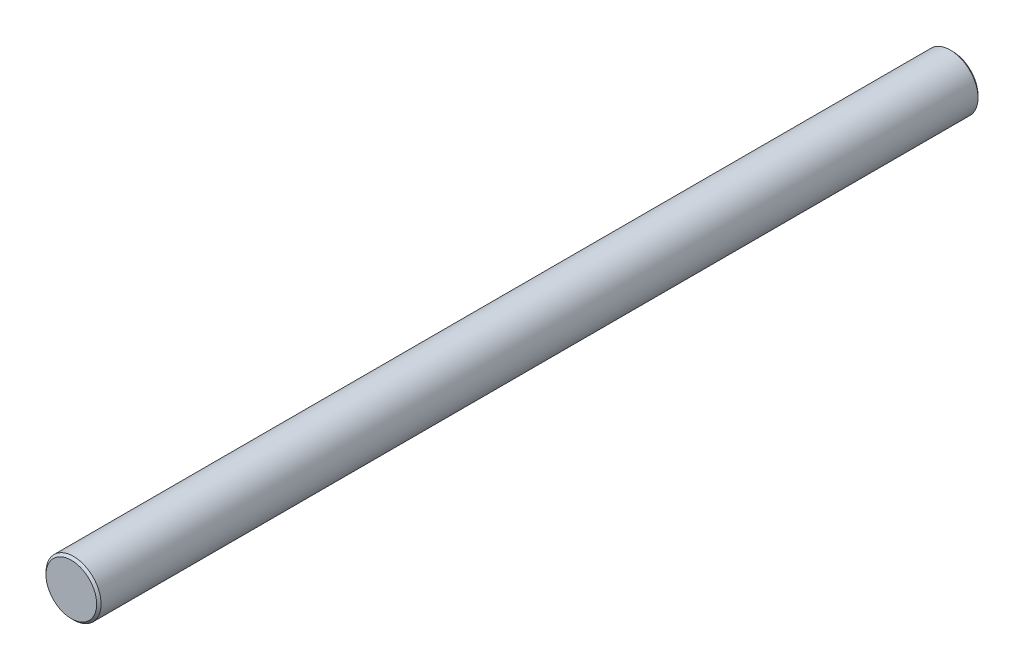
ISO-10303-21;
HEADER;
FILE_DESCRIPTION(('STEP AP214'),'2;1');
FILE_NAME('part.step','',(''),(''),'','','');
FILE_SCHEMA(('AUTOMOTIVE_DESIGN { 1 0 10303 214 1 1 1 1 }'));
ENDSEC;
DATA;
#1=APPLICATION_CONTEXT('core data for automotive mechanical design processes');
#2=APPLICATION_PROTOCOL_DEFINITION('international standard','automotive_design',2000,#1);
#3=PRODUCT_CONTEXT('',#1,'mechanical');
#4=PRODUCT('Part','Part','',(#3));
#5=PRODUCT_RELATED_PRODUCT_CATEGORY('part','',(#4));
#6=PRODUCT_DEFINITION_FORMATION('','',#4);
#7=PRODUCT_DEFINITION_CONTEXT('part definition',#1,'design');
#8=PRODUCT_DEFINITION('design','',#6,#7);
#9=PRODUCT_DEFINITION_SHAPE('','',#8);
#10=(LENGTH_UNIT() NAMED_UNIT(*) SI_UNIT(.MILLI.,.METRE.));
#11=(NAMED_UNIT(*) PLANE_ANGLE_UNIT() SI_UNIT($,.RADIAN.));
#12=(NAMED_UNIT(*) SI_UNIT($,.STERADIAN.) SOLID_ANGLE_UNIT());
#13=UNCERTAINTY_MEASURE_WITH_UNIT(LENGTH_MEASURE(1.E-05),#10,'distance_accuracy_value','');
#14=(GEOMETRIC_REPRESENTATION_CONTEXT(3) GLOBAL_UNCERTAINTY_ASSIGNED_CONTEXT((#13)) GLOBAL_UNIT_ASSIGNED_CONTEXT((#10,
#11,#12)) REPRESENTATION_CONTEXT('',''));
#15=CARTESIAN_POINT('',(0.,0.,0.));
#16=DIRECTION('',(0.,0.,1.));
#17=DIRECTION('',(1.,0.,0.));
#18=AXIS2_PLACEMENT_3D('',#15,#16,#17);
#19=CARTESIAN_POINT('',(0.,0.,304.8));
#20=DIRECTION('',(0.,0.,-1.));
#21=DIRECTION('',(-1.,0.,0.));
#22=AXIS2_PLACEMENT_3D('',#19,#20,#21);
#23=CYLINDRICAL_SURFACE('',#22,9.525);
#24=CARTESIAN_POINT('',(0.,0.,0.762000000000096));
#25=DIRECTION('',(0.,0.,1.));
#26=DIRECTION('',(1.,0.,0.));
#27=AXIS2_PLACEMENT_3D('',#24,#25,#26);
#28=CIRCLE('',#27,9.525);
#29=CARTESIAN_POINT('',(-9.525,0.,0.76200000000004));
#30=VERTEX_POINT('',#29);
#31=EDGE_CURVE('E42',#30,#30,#28,.T.);
#32=CARTESIAN_POINT('',(0.,0.,304.038));
#33=DIRECTION('',(0.,0.,1.));
#34=DIRECTION('',(1.,0.,0.));
#35=AXIS2_PLACEMENT_3D('',#32,#33,#34);
#36=CIRCLE('',#35,9.525);
#37=CARTESIAN_POINT('',(-9.525,0.,304.038));
#38=VERTEX_POINT('',#37);
#39=EDGE_CURVE('E46',#38,#38,#36,.F.);
#40=CARTESIAN_POINT('',(-9.525,0.,0.76200000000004));
#41=CARTESIAN_POINT('',(-9.525,0.,3.92112500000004));
#42=CARTESIAN_POINT('',(-9.525,0.,7.08025000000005));
#43=CARTESIAN_POINT('',(-9.525,0.,13.3985000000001));
#44=CARTESIAN_POINT('',(-9.525,0.,16.5576250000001));
#45=CARTESIAN_POINT('',(-9.525,0.,22.875875));
#46=CARTESIAN_POINT('',(-9.525,0.,26.035));
#47=CARTESIAN_POINT('',(-9.525,0.,32.35325));
#48=CARTESIAN_POINT('',(-9.525,0.,35.512375));
#49=CARTESIAN_POINT('',(-9.525,0.,41.830625));
#50=CARTESIAN_POINT('',(-9.525,0.,44.98975));
#51=CARTESIAN_POINT('',(-9.525,0.,51.308));
#52=CARTESIAN_POINT('',(-9.525,0.,54.467125));
#53=CARTESIAN_POINT('',(-9.525,0.,60.785375));
#54=CARTESIAN_POINT('',(-9.525,0.,63.9445));
#55=CARTESIAN_POINT('',(-9.525,0.,70.26275));
#56=CARTESIAN_POINT('',(-9.525,0.,73.421875));
#57=CARTESIAN_POINT('',(-9.525,0.,79.740125));
#58=CARTESIAN_POINT('',(-9.525,0.,82.89925));
#59=CARTESIAN_POINT('',(-9.525,0.,89.2175));
#60=CARTESIAN_POINT('',(-9.525,0.,92.376625));
#61=CARTESIAN_POINT('',(-9.525,0.,98.694875));
#62=CARTESIAN_POINT('',(-9.525,0.,101.854));
#63=CARTESIAN_POINT('',(-9.525,0.,108.17225));
#64=CARTESIAN_POINT('',(-9.525,0.,111.331375));
#65=CARTESIAN_POINT('',(-9.525,0.,117.649625));
#66=CARTESIAN_POINT('',(-9.525,0.,120.80875));
#67=CARTESIAN_POINT('',(-9.525,0.,127.127));
#68=CARTESIAN_POINT('',(-9.525,0.,130.286125));
#69=CARTESIAN_POINT('',(-9.525,0.,136.604375));
#70=CARTESIAN_POINT('',(-9.525,0.,139.7635));
#71=CARTESIAN_POINT('',(-9.525,0.,146.08175));
#72=CARTESIAN_POINT('',(-9.525,0.,149.240875));
#73=CARTESIAN_POINT('',(-9.525,0.,155.559125));
#74=CARTESIAN_POINT('',(-9.525,0.,158.71825));
#75=CARTESIAN_POINT('',(-9.525,0.,165.0365));
#76=CARTESIAN_POINT('',(-9.525,0.,168.195625));
#77=CARTESIAN_POINT('',(-9.525,0.,174.513875));
#78=CARTESIAN_POINT('',(-9.525,0.,177.673));
#79=CARTESIAN_POINT('',(-9.525,0.,183.99125));
#80=CARTESIAN_POINT('',(-9.525,0.,187.150375));
#81=CARTESIAN_POINT('',(-9.525,0.,193.468625));
#82=CARTESIAN_POINT('',(-9.525,0.,196.62775));
#83=CARTESIAN_POINT('',(-9.525,0.,202.946));
#84=CARTESIAN_POINT('',(-9.525,0.,206.105125));
#85=CARTESIAN_POINT('',(-9.525,0.,212.423375));
#86=CARTESIAN_POINT('',(-9.525,0.,215.5825));
#87=CARTESIAN_POINT('',(-9.525,0.,221.90075));
#88=CARTESIAN_POINT('',(-9.525,0.,225.059875));
#89=CARTESIAN_POINT('',(-9.525,0.,231.378125));
#90=CARTESIAN_POINT('',(-9.525,0.,234.53725));
#91=CARTESIAN_POINT('',(-9.525,0.,240.8555));
#92=CARTESIAN_POINT('',(-9.525,0.,244.014625));
#93=CARTESIAN_POINT('',(-9.525,0.,250.332875));
#94=CARTESIAN_POINT('',(-9.525,0.,253.492));
#95=CARTESIAN_POINT('',(-9.525,0.,259.81025));
#96=CARTESIAN_POINT('',(-9.525,0.,262.969375));
#97=CARTESIAN_POINT('',(-9.525,0.,269.287625));
#98=CARTESIAN_POINT('',(-9.525,0.,272.44675));
#99=CARTESIAN_POINT('',(-9.525,0.,278.765));
#100=CARTESIAN_POINT('',(-9.525,0.,281.924125));
#101=CARTESIAN_POINT('',(-9.525,0.,288.242375));
#102=CARTESIAN_POINT('',(-9.525,0.,291.4015));
#103=CARTESIAN_POINT('',(-9.525,0.,297.71975));
#104=CARTESIAN_POINT('',(-9.525,0.,300.878875));
#105=CARTESIAN_POINT('',(-9.525,0.,304.038));
#106=B_SPLINE_CURVE_WITH_KNOTS('',3,(#40,#41,#42,#43,#44,#45,#46,#47,#48,#49,#50,#51,#52,#53,
#54,#55,#56,#57,#58,#59,#60,#61,#62,#63,#64,#65,#66,#67,#68,#69,#70,#71,#72,#73,#74,#75,#76,#77,
#78,#79,#80,#81,#82,#83,#84,#85,#86,#87,#88,#89,#90,#91,#92,#93,#94,#95,#96,#97,#98,#99,#100,
#101,#102,#103,#104,#105),.UNSPECIFIED.,.F.,.F.,(4,2,2,2,2,2,2,2,2,2,2,2,2,2,2,2,2,2,2,2,2,2,2,
2,2,2,2,2,2,2,2,2,4),(0.,9.47737500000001,18.95475,28.432125,37.9095,47.386875,56.86425,
66.341625,75.819,85.296375,94.77375,104.251125,113.7285,123.205875,132.68325,142.160625,151.638,
161.115375,170.59275,180.070125,189.5475,199.024875,208.50225,217.979625,227.457,236.934375,
246.41175,255.889125,265.3665,274.843875,284.32125,293.798625,303.276),.UNSPECIFIED.);
#107=EDGE_CURVE('BSEAM31',#30,#38,#106,.T.);
#108=ORIENTED_EDGE('',*,*,#31,.T.);
#109=ORIENTED_EDGE('',*,*,#39,.T.);
#110=ORIENTED_EDGE('',*,*,#107,.T.);
#111=ORIENTED_EDGE('',*,*,#107,.F.);
#112=EDGE_LOOP('',(#108,#110,#109,#111));
#113=FACE_BOUND('',#112,.T.);
#114=ADVANCED_FACE('F31',(#113),#23,.T.);
#115=CARTESIAN_POINT('',(0.,0.,304.8));
#116=DIRECTION('',(0.,0.,1.));
#117=DIRECTION('',(1.,0.,0.));
#118=AXIS2_PLACEMENT_3D('',#115,#116,#117);
#119=PLANE('',#118);
#120=CARTESIAN_POINT('',(0.,0.,304.8));
#121=DIRECTION('',(0.,0.,1.));
#122=DIRECTION('',(1.,0.,0.));
#123=AXIS2_PLACEMENT_3D('',#120,#121,#122);
#124=CIRCLE('',#123,8.76300000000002);
#125=CARTESIAN_POINT('',(8.76300000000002,0.,304.8));
#126=VERTEX_POINT('',#125);
#127=EDGE_CURVE('E10',#126,#126,#124,.T.);
#128=ORIENTED_EDGE('',*,*,#127,.T.);
#129=EDGE_LOOP('',(#128));
#130=FACE_BOUND('',#129,.T.);
#131=ADVANCED_FACE('F62',(#130),#119,.T.);
#132=CARTESIAN_POINT('',(0.,0.,0.));
#133=DIRECTION('',(0.,0.,1.));
#134=DIRECTION('',(1.,0.,0.));
#135=AXIS2_PLACEMENT_3D('',#132,#133,#134);
#136=PLANE('',#135);
#137=CARTESIAN_POINT('',(0.,0.,0.));
#138=DIRECTION('',(0.,0.,1.));
#139=DIRECTION('',(1.,0.,0.));
#140=AXIS2_PLACEMENT_3D('',#137,#138,#139);
#141=CIRCLE('',#140,8.76299999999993);
#142=CARTESIAN_POINT('',(8.76299999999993,0.,0.));
#143=VERTEX_POINT('',#142);
#144=EDGE_CURVE('E38',#143,#143,#141,.F.);
#145=ORIENTED_EDGE('',*,*,#144,.T.);
#146=EDGE_LOOP('',(#145));
#147=FACE_BOUND('',#146,.T.);
#148=ADVANCED_FACE('F59',(#147),#136,.F.);
#149=CARTESIAN_POINT('',(0.,0.,0.762000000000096));
#150=DIRECTION('',(0.,0.,1.));
#151=DIRECTION('',(1.,0.,0.));
#152=AXIS2_PLACEMENT_3D('',#149,#150,#151);
#153=CONICAL_SURFACE('',#152,9.525,0.785398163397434);
#154=ORIENTED_EDGE('',*,*,#144,.F.);
#155=EDGE_LOOP('',(#154));
#156=FACE_BOUND('',#155,.T.);
#157=ORIENTED_EDGE('',*,*,#31,.F.);
#158=EDGE_LOOP('',(#157));
#159=FACE_BOUND('',#158,.T.);
#160=ADVANCED_FACE('F55',(#156,#159),#153,.T.);
#161=CARTESIAN_POINT('',(0.,0.,304.8));
#162=DIRECTION('',(0.,0.,-1.));
#163=DIRECTION('',(-1.,0.,0.));
#164=AXIS2_PLACEMENT_3D('',#161,#162,#163);
#165=CONICAL_SURFACE('',#164,8.76300000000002,0.785398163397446);
#166=ORIENTED_EDGE('',*,*,#39,.F.);
#167=EDGE_LOOP('',(#166));
#168=FACE_BOUND('',#167,.T.);
#169=ORIENTED_EDGE('',*,*,#127,.F.);
#170=EDGE_LOOP('',(#169));
#171=FACE_BOUND('',#170,.T.);
#172=ADVANCED_FACE('F33',(#168,#171),#165,.T.);
#173=CLOSED_SHELL('',(#114,#131,#148,#160,#172));
#174=MANIFOLD_SOLID_BREP('B2',#173);
#175=ADVANCED_BREP_SHAPE_REPRESENTATION('',(#18,#174),#14);
#176=SHAPE_DEFINITION_REPRESENTATION(#9,#175);
ENDSEC;
END-ISO-10303-21;
